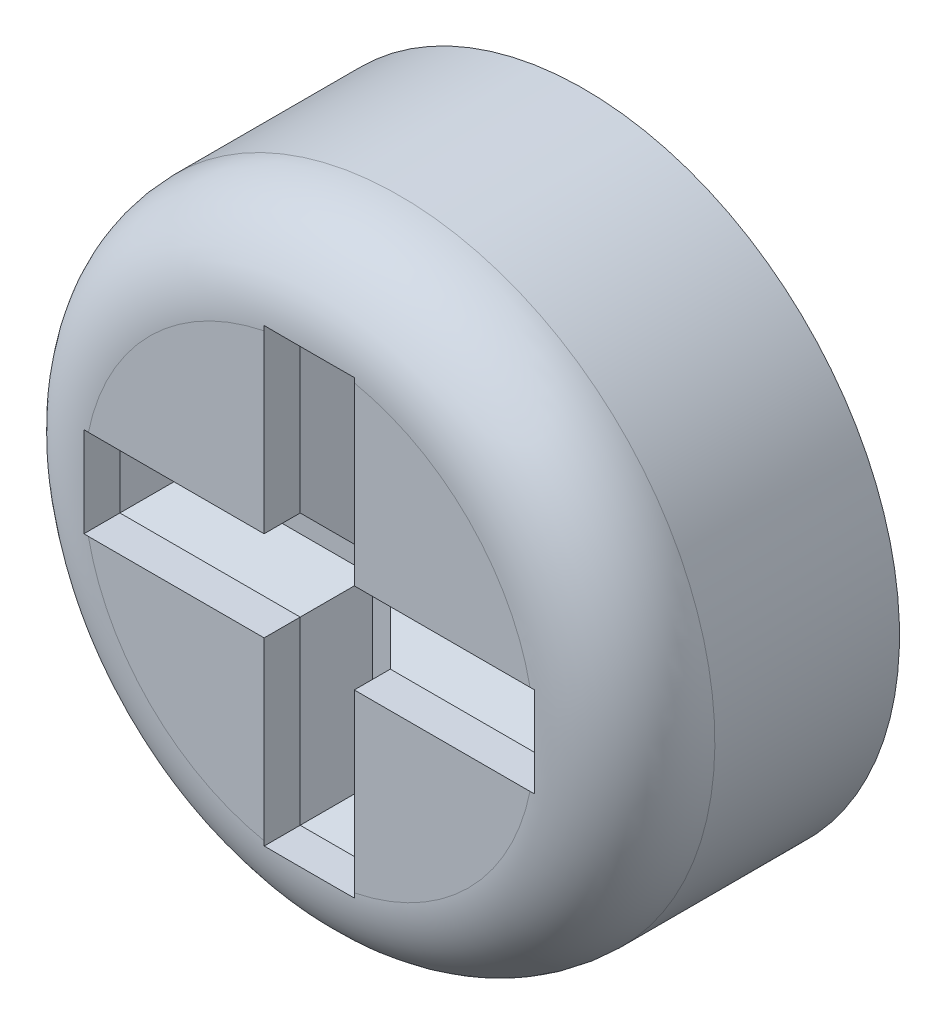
from build123d import *

# Parameters (mm, degrees)
SKETCH1_R          = 1.75
EXTRUDE1_DEPTH     = 1.524
FILLET1_R          = 0.5
CUT_EXTRUDE2_DEPTH = 0.4
CHAMFER1_SIZE      = 0.2


with BuildPart() as part:
    # Sketch1 → Extrude1 (new body)
    with BuildSketch(Plane.XY):
        with Locations(Location((0, 0, 0), (0, 0, 180))):
            Circle(SKETCH1_R)
    extrude(amount=EXTRUDE1_DEPTH)

    # Fillet1
    fillet1_edges = [part.edges().sort_by_distance(p)[0] for p in [
        (1.75, 0, 1.524),
    ]]
    fillet(fillet1_edges, radius=FILLET1_R)

    # Sketch2 → Cut-Extrude2 (cut)
    with BuildSketch(Plane.XY.offset(1.524)):
        Polygon((0.25, -0.25), (0.25, -1.25), (-0.25, -1.25), (-0.25, -0.25), (-1.25, -0.25), (-1.25, 0.25), (-0.25, 0.25), (-0.25, 1.25), (0.25, 1.25), (0.25, 0.25), (1.25, 0.25), (1.25, -0.25), align=None)
    extrude(amount=-CUT_EXTRUDE2_DEPTH, mode=Mode.SUBTRACT)

    # Chamfer1
    chamfer1_edges = [part.edges().sort_by_distance(p)[0] for p in [
        (-0.75, -0.25, 1.124),
        (0.25, -0.75, 1.124),
        (0, -1.25, 1.124),
        (-0.25, -0.75, 1.124),
        (-1.25, 0, 1.124),
        (-0.75, 0.25, 1.124),
        (-0.25, 0.75, 1.124),
        (0, 1.25, 1.124),
        (0.25, 0.75, 1.124),
        (0.75, 0.25, 1.124),
        (1.25, 0, 1.124),
        (0.75, -0.25, 1.124),
    ]]
    chamfer(chamfer1_edges, length=CHAMFER1_SIZE)


solid = part.part
